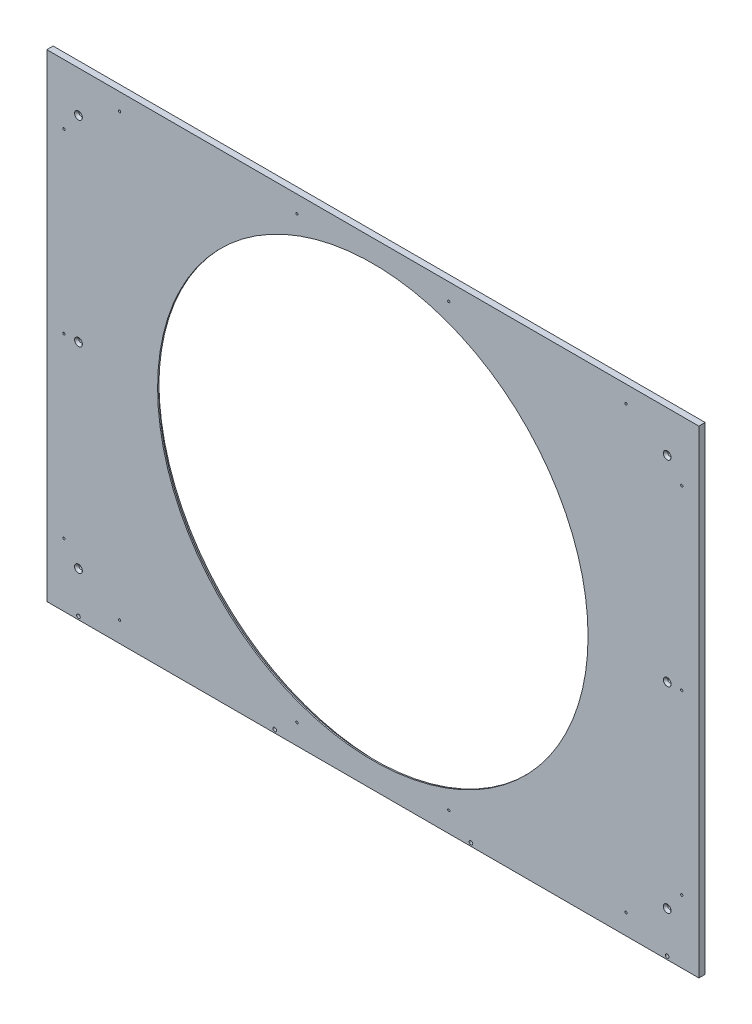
ISO-10303-21;
HEADER;
FILE_DESCRIPTION(('STEP AP214'),'2;1');
FILE_NAME('part.step','',(''),(''),'','','');
FILE_SCHEMA(('AUTOMOTIVE_DESIGN { 1 0 10303 214 1 1 1 1 }'));
ENDSEC;
DATA;
#1=APPLICATION_CONTEXT('core data for automotive mechanical design processes');
#2=APPLICATION_PROTOCOL_DEFINITION('international standard','automotive_design',2000,#1);
#3=PRODUCT_CONTEXT('',#1,'mechanical');
#4=PRODUCT('Part','Part','',(#3));
#5=PRODUCT_RELATED_PRODUCT_CATEGORY('part','',(#4));
#6=PRODUCT_DEFINITION_FORMATION('','',#4);
#7=PRODUCT_DEFINITION_CONTEXT('part definition',#1,'design');
#8=PRODUCT_DEFINITION('design','',#6,#7);
#9=PRODUCT_DEFINITION_SHAPE('','',#8);
#10=(LENGTH_UNIT() NAMED_UNIT(*) SI_UNIT(.MILLI.,.METRE.));
#11=(NAMED_UNIT(*) PLANE_ANGLE_UNIT() SI_UNIT($,.RADIAN.));
#12=(NAMED_UNIT(*) SI_UNIT($,.STERADIAN.) SOLID_ANGLE_UNIT());
#13=UNCERTAINTY_MEASURE_WITH_UNIT(LENGTH_MEASURE(1.E-05),#10,'distance_accuracy_value','');
#14=(GEOMETRIC_REPRESENTATION_CONTEXT(3) GLOBAL_UNCERTAINTY_ASSIGNED_CONTEXT((#13)) GLOBAL_UNIT_ASSIGNED_CONTEXT((#10,
#11,#12)) REPRESENTATION_CONTEXT('',''));
#15=CARTESIAN_POINT('',(0.,0.,0.));
#16=DIRECTION('',(0.,0.,1.));
#17=DIRECTION('',(1.,0.,0.));
#18=AXIS2_PLACEMENT_3D('',#15,#16,#17);
#19=CARTESIAN_POINT('',(0.,0.,6.35));
#20=DIRECTION('',(0.,0.,1.));
#21=DIRECTION('',(1.,0.,0.));
#22=AXIS2_PLACEMENT_3D('',#19,#20,#21);
#23=PLANE('',#22);
#24=CARTESIAN_POINT('',(-295.275,198.4375,6.35));
#25=DIRECTION('',(0.,0.,1.));
#26=DIRECTION('',(1.,0.,0.));
#27=AXIS2_PLACEMENT_3D('',#24,#25,#26);
#28=CIRCLE('',#27,3.89889999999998);
#29=CARTESIAN_POINT('',(-291.3761,198.4375,6.35));
#30=VERTEX_POINT('',#29);
#31=EDGE_CURVE('E319',#30,#30,#28,.T.);
#32=ORIENTED_EDGE('',*,*,#31,.F.);
#33=EDGE_LOOP('',(#32));
#34=FACE_BOUND('',#33,.T.);
#35=CARTESIAN_POINT('',(-295.275,1.58749999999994,6.35));
#36=DIRECTION('',(0.,0.,1.));
#37=DIRECTION('',(1.,0.,0.));
#38=AXIS2_PLACEMENT_3D('',#35,#36,#37);
#39=CIRCLE('',#38,3.89889999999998);
#40=CARTESIAN_POINT('',(-291.3761,1.58749999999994,6.35));
#41=VERTEX_POINT('',#40);
#42=EDGE_CURVE('E310',#41,#41,#39,.T.);
#43=ORIENTED_EDGE('',*,*,#42,.F.);
#44=EDGE_LOOP('',(#43));
#45=FACE_BOUND('',#44,.T.);
#46=CARTESIAN_POINT('',(-295.275,-195.2625,6.35));
#47=DIRECTION('',(0.,0.,1.));
#48=DIRECTION('',(1.,0.,0.));
#49=AXIS2_PLACEMENT_3D('',#46,#47,#48);
#50=CIRCLE('',#49,3.89889999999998);
#51=CARTESIAN_POINT('',(-291.3761,-195.2625,6.35));
#52=VERTEX_POINT('',#51);
#53=EDGE_CURVE('E301',#52,#52,#50,.T.);
#54=ORIENTED_EDGE('',*,*,#53,.F.);
#55=EDGE_LOOP('',(#54));
#56=FACE_BOUND('',#55,.T.);
#57=CARTESIAN_POINT('',(295.275,-195.2625,6.35));
#58=DIRECTION('',(0.,0.,1.));
#59=DIRECTION('',(1.,0.,0.));
#60=AXIS2_PLACEMENT_3D('',#57,#58,#59);
#61=CIRCLE('',#60,3.89889999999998);
#62=CARTESIAN_POINT('',(299.1739,-195.2625,6.35));
#63=VERTEX_POINT('',#62);
#64=EDGE_CURVE('E292',#63,#63,#61,.T.);
#65=ORIENTED_EDGE('',*,*,#64,.F.);
#66=EDGE_LOOP('',(#65));
#67=FACE_BOUND('',#66,.T.);
#68=CARTESIAN_POINT('',(295.275,1.58749999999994,6.35));
#69=DIRECTION('',(0.,0.,1.));
#70=DIRECTION('',(1.,0.,0.));
#71=AXIS2_PLACEMENT_3D('',#68,#69,#70);
#72=CIRCLE('',#71,3.89889999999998);
#73=CARTESIAN_POINT('',(299.1739,1.58749999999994,6.35));
#74=VERTEX_POINT('',#73);
#75=EDGE_CURVE('E283',#74,#74,#72,.T.);
#76=ORIENTED_EDGE('',*,*,#75,.F.);
#77=EDGE_LOOP('',(#76));
#78=FACE_BOUND('',#77,.T.);
#79=CARTESIAN_POINT('',(295.275,198.4375,6.35));
#80=DIRECTION('',(0.,0.,1.));
#81=DIRECTION('',(1.,0.,0.));
#82=AXIS2_PLACEMENT_3D('',#79,#80,#81);
#83=CIRCLE('',#82,3.89889999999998);
#84=CARTESIAN_POINT('',(299.1739,198.4375,6.35));
#85=VERTEX_POINT('',#84);
#86=EDGE_CURVE('E274',#85,#85,#83,.T.);
#87=ORIENTED_EDGE('',*,*,#86,.F.);
#88=EDGE_LOOP('',(#87));
#89=FACE_BOUND('',#88,.T.);
#90=CARTESIAN_POINT('',(-295.275,-236.5375,6.35));
#91=DIRECTION('',(0.,0.,1.));
#92=DIRECTION('',(1.,0.,0.));
#93=AXIS2_PLACEMENT_3D('',#90,#91,#92);
#94=CIRCLE('',#93,1.82880000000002);
#95=CARTESIAN_POINT('',(-293.4462,-236.5375,6.35));
#96=VERTEX_POINT('',#95);
#97=EDGE_CURVE('E265',#96,#96,#94,.T.);
#98=ORIENTED_EDGE('',*,*,#97,.F.);
#99=EDGE_LOOP('',(#98));
#100=FACE_BOUND('',#99,.T.);
#101=CARTESIAN_POINT('',(-98.425,-236.5375,6.35));
#102=DIRECTION('',(0.,0.,1.));
#103=DIRECTION('',(1.,0.,0.));
#104=AXIS2_PLACEMENT_3D('',#101,#102,#103);
#105=CIRCLE('',#104,1.82880000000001);
#106=CARTESIAN_POINT('',(-96.5962,-236.5375,6.35));
#107=VERTEX_POINT('',#106);
#108=EDGE_CURVE('E259',#107,#107,#105,.T.);
#109=ORIENTED_EDGE('',*,*,#108,.F.);
#110=EDGE_LOOP('',(#109));
#111=FACE_BOUND('',#110,.T.);
#112=CARTESIAN_POINT('',(98.425,-236.5375,6.35));
#113=DIRECTION('',(0.,0.,1.));
#114=DIRECTION('',(1.,0.,0.));
#115=AXIS2_PLACEMENT_3D('',#112,#113,#114);
#116=CIRCLE('',#115,1.82880000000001);
#117=CARTESIAN_POINT('',(100.2538,-236.5375,6.35));
#118=VERTEX_POINT('',#117);
#119=EDGE_CURVE('E253',#118,#118,#116,.T.);
#120=ORIENTED_EDGE('',*,*,#119,.F.);
#121=EDGE_LOOP('',(#120));
#122=FACE_BOUND('',#121,.T.);
#123=CARTESIAN_POINT('',(295.275,-236.5375,6.35));
#124=DIRECTION('',(0.,0.,1.));
#125=DIRECTION('',(1.,0.,0.));
#126=AXIS2_PLACEMENT_3D('',#123,#124,#125);
#127=CIRCLE('',#126,1.82880000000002);
#128=CARTESIAN_POINT('',(297.1038,-236.5375,6.35));
#129=VERTEX_POINT('',#128);
#130=EDGE_CURVE('E247',#129,#129,#127,.T.);
#131=ORIENTED_EDGE('',*,*,#130,.F.);
#132=EDGE_LOOP('',(#131));
#133=FACE_BOUND('',#132,.T.);
#134=CARTESIAN_POINT('',(-254.,222.5675,6.35));
#135=DIRECTION('',(0.,0.,1.));
#136=DIRECTION('',(1.,0.,0.));
#137=AXIS2_PLACEMENT_3D('',#134,#135,#136);
#138=CIRCLE('',#137,1.13029999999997);
#139=CARTESIAN_POINT('',(-252.8697,222.5675,6.35));
#140=VERTEX_POINT('',#139);
#141=EDGE_CURVE('E241',#140,#140,#138,.T.);
#142=ORIENTED_EDGE('',*,*,#141,.F.);
#143=EDGE_LOOP('',(#142));
#144=FACE_BOUND('',#143,.T.);
#145=CARTESIAN_POINT('',(-76.2,222.5675,6.35));
#146=DIRECTION('',(0.,0.,1.));
#147=DIRECTION('',(1.,0.,0.));
#148=AXIS2_PLACEMENT_3D('',#145,#146,#147);
#149=CIRCLE('',#148,1.1303);
#150=CARTESIAN_POINT('',(-75.0697,222.5675,6.35));
#151=VERTEX_POINT('',#150);
#152=EDGE_CURVE('E235',#151,#151,#149,.T.);
#153=ORIENTED_EDGE('',*,*,#152,.F.);
#154=EDGE_LOOP('',(#153));
#155=FACE_BOUND('',#154,.T.);
#156=CARTESIAN_POINT('',(76.2,222.5675,6.35));
#157=DIRECTION('',(0.,0.,1.));
#158=DIRECTION('',(1.,0.,0.));
#159=AXIS2_PLACEMENT_3D('',#156,#157,#158);
#160=CIRCLE('',#159,1.1303);
#161=CARTESIAN_POINT('',(77.3303,222.5675,6.35));
#162=VERTEX_POINT('',#161);
#163=EDGE_CURVE('E229',#162,#162,#160,.T.);
#164=ORIENTED_EDGE('',*,*,#163,.F.);
#165=EDGE_LOOP('',(#164));
#166=FACE_BOUND('',#165,.T.);
#167=CARTESIAN_POINT('',(254.,222.5675,6.35));
#168=DIRECTION('',(0.,0.,1.));
#169=DIRECTION('',(1.,0.,0.));
#170=AXIS2_PLACEMENT_3D('',#167,#168,#169);
#171=CIRCLE('',#170,1.13029999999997);
#172=CARTESIAN_POINT('',(255.1303,222.5675,6.35));
#173=VERTEX_POINT('',#172);
#174=EDGE_CURVE('E223',#173,#173,#171,.T.);
#175=ORIENTED_EDGE('',*,*,#174,.F.);
#176=EDGE_LOOP('',(#175));
#177=FACE_BOUND('',#176,.T.);
#178=CARTESIAN_POINT('',(254.,-219.3925,6.35));
#179=DIRECTION('',(0.,0.,1.));
#180=DIRECTION('',(1.,0.,0.));
#181=AXIS2_PLACEMENT_3D('',#178,#179,#180);
#182=CIRCLE('',#181,1.13029999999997);
#183=CARTESIAN_POINT('',(255.1303,-219.3925,6.35));
#184=VERTEX_POINT('',#183);
#185=EDGE_CURVE('E217',#184,#184,#182,.T.);
#186=ORIENTED_EDGE('',*,*,#185,.F.);
#187=EDGE_LOOP('',(#186));
#188=FACE_BOUND('',#187,.T.);
#189=CARTESIAN_POINT('',(76.2000000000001,-219.3925,6.35));
#190=DIRECTION('',(0.,0.,1.));
#191=DIRECTION('',(1.,0.,0.));
#192=AXIS2_PLACEMENT_3D('',#189,#190,#191);
#193=CIRCLE('',#192,1.1303);
#194=CARTESIAN_POINT('',(77.3303000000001,-219.3925,6.35));
#195=VERTEX_POINT('',#194);
#196=EDGE_CURVE('E211',#195,#195,#193,.T.);
#197=ORIENTED_EDGE('',*,*,#196,.F.);
#198=EDGE_LOOP('',(#197));
#199=FACE_BOUND('',#198,.T.);
#200=CARTESIAN_POINT('',(-76.2,-219.3925,6.35));
#201=DIRECTION('',(0.,0.,1.));
#202=DIRECTION('',(1.,0.,0.));
#203=AXIS2_PLACEMENT_3D('',#200,#201,#202);
#204=CIRCLE('',#203,1.1303);
#205=CARTESIAN_POINT('',(-75.0697,-219.3925,6.35));
#206=VERTEX_POINT('',#205);
#207=EDGE_CURVE('E205',#206,#206,#204,.T.);
#208=ORIENTED_EDGE('',*,*,#207,.F.);
#209=EDGE_LOOP('',(#208));
#210=FACE_BOUND('',#209,.T.);
#211=CARTESIAN_POINT('',(-254.,-219.3925,6.35));
#212=DIRECTION('',(0.,0.,1.));
#213=DIRECTION('',(1.,0.,0.));
#214=AXIS2_PLACEMENT_3D('',#211,#212,#213);
#215=CIRCLE('',#214,1.13029999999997);
#216=CARTESIAN_POINT('',(-252.8697,-219.3925,6.35));
#217=VERTEX_POINT('',#216);
#218=EDGE_CURVE('E199',#217,#217,#215,.T.);
#219=ORIENTED_EDGE('',*,*,#218,.F.);
#220=EDGE_LOOP('',(#219));
#221=FACE_BOUND('',#220,.T.);
#222=CARTESIAN_POINT('',(-309.88,179.3875,6.35));
#223=DIRECTION('',(0.,0.,1.));
#224=DIRECTION('',(1.,0.,0.));
#225=AXIS2_PLACEMENT_3D('',#222,#223,#224);
#226=CIRCLE('',#225,1.13029999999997);
#227=CARTESIAN_POINT('',(-308.7497,179.3875,6.35));
#228=VERTEX_POINT('',#227);
#229=EDGE_CURVE('E193',#228,#228,#226,.T.);
#230=ORIENTED_EDGE('',*,*,#229,.F.);
#231=EDGE_LOOP('',(#230));
#232=FACE_BOUND('',#231,.T.);
#233=CARTESIAN_POINT('',(-309.88,-176.2125,6.35));
#234=DIRECTION('',(0.,0.,1.));
#235=DIRECTION('',(1.,0.,0.));
#236=AXIS2_PLACEMENT_3D('',#233,#234,#235);
#237=CIRCLE('',#236,1.13029999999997);
#238=CARTESIAN_POINT('',(-308.7497,-176.2125,6.35));
#239=VERTEX_POINT('',#238);
#240=EDGE_CURVE('E187',#239,#239,#237,.T.);
#241=ORIENTED_EDGE('',*,*,#240,.F.);
#242=EDGE_LOOP('',(#241));
#243=FACE_BOUND('',#242,.T.);
#244=CARTESIAN_POINT('',(309.88,-176.2125,6.35));
#245=DIRECTION('',(0.,0.,1.));
#246=DIRECTION('',(1.,0.,0.));
#247=AXIS2_PLACEMENT_3D('',#244,#245,#246);
#248=CIRCLE('',#247,1.13029999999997);
#249=CARTESIAN_POINT('',(311.0103,-176.2125,6.35));
#250=VERTEX_POINT('',#249);
#251=EDGE_CURVE('E181',#250,#250,#248,.T.);
#252=ORIENTED_EDGE('',*,*,#251,.F.);
#253=EDGE_LOOP('',(#252));
#254=FACE_BOUND('',#253,.T.);
#255=CARTESIAN_POINT('',(309.88,1.58749999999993,6.35));
#256=DIRECTION('',(0.,0.,1.));
#257=DIRECTION('',(1.,0.,0.));
#258=AXIS2_PLACEMENT_3D('',#255,#256,#257);
#259=CIRCLE('',#258,1.13029999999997);
#260=CARTESIAN_POINT('',(311.0103,1.58749999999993,6.35));
#261=VERTEX_POINT('',#260);
#262=EDGE_CURVE('E175',#261,#261,#259,.T.);
#263=ORIENTED_EDGE('',*,*,#262,.F.);
#264=EDGE_LOOP('',(#263));
#265=FACE_BOUND('',#264,.T.);
#266=CARTESIAN_POINT('',(309.88,179.3875,6.35));
#267=DIRECTION('',(0.,0.,1.));
#268=DIRECTION('',(1.,0.,0.));
#269=AXIS2_PLACEMENT_3D('',#266,#267,#268);
#270=CIRCLE('',#269,1.13029999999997);
#271=CARTESIAN_POINT('',(311.0103,179.3875,6.35));
#272=VERTEX_POINT('',#271);
#273=EDGE_CURVE('E169',#272,#272,#270,.T.);
#274=ORIENTED_EDGE('',*,*,#273,.F.);
#275=EDGE_LOOP('',(#274));
#276=FACE_BOUND('',#275,.T.);
#277=CARTESIAN_POINT('',(-309.88,1.58749999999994,6.35));
#278=DIRECTION('',(0.,0.,1.));
#279=DIRECTION('',(1.,0.,0.));
#280=AXIS2_PLACEMENT_3D('',#277,#278,#279);
#281=CIRCLE('',#280,1.13029999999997);
#282=CARTESIAN_POINT('',(-308.7497,1.58749999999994,6.35));
#283=VERTEX_POINT('',#282);
#284=EDGE_CURVE('E163',#283,#283,#281,.T.);
#285=ORIENTED_EDGE('',*,*,#284,.F.);
#286=EDGE_LOOP('',(#285));
#287=FACE_BOUND('',#286,.T.);
#288=DIRECTION('',(0.,-1.,0.));
#289=VECTOR('',#288,1.);
#290=CARTESIAN_POINT('',(-327.025,239.7125,6.35));
#291=LINE('',#290,#289);
#292=CARTESIAN_POINT('',(-327.025,239.7125,6.35));
#293=VERTEX_POINT('',#292);
#294=CARTESIAN_POINT('',(-327.025,-239.7125,6.35));
#295=VERTEX_POINT('',#294);
#296=EDGE_CURVE('E88',#293,#295,#291,.T.);
#297=ORIENTED_EDGE('',*,*,#296,.T.);
#298=DIRECTION('',(1.,0.,0.));
#299=VECTOR('',#298,1.);
#300=CARTESIAN_POINT('',(-327.025,-239.7125,6.35));
#301=LINE('',#300,#299);
#302=CARTESIAN_POINT('',(327.025,-239.7125,6.35));
#303=VERTEX_POINT('',#302);
#304=EDGE_CURVE('E83',#295,#303,#301,.T.);
#305=ORIENTED_EDGE('',*,*,#304,.T.);
#306=DIRECTION('',(0.,1.,0.));
#307=VECTOR('',#306,1.);
#308=CARTESIAN_POINT('',(327.025,239.7125,6.35));
#309=LINE('',#308,#307);
#310=CARTESIAN_POINT('',(327.025,239.7125,6.35));
#311=VERTEX_POINT('',#310);
#312=EDGE_CURVE('E86',#303,#311,#309,.T.);
#313=ORIENTED_EDGE('',*,*,#312,.T.);
#314=DIRECTION('',(-1.,0.,0.));
#315=VECTOR('',#314,1.);
#316=CARTESIAN_POINT('',(-327.025,239.7125,6.35));
#317=LINE('',#316,#315);
#318=EDGE_CURVE('E52',#311,#293,#317,.T.);
#319=ORIENTED_EDGE('',*,*,#318,.T.);
#320=EDGE_LOOP('',(#297,#305,#313,#319));
#321=FACE_BOUND('',#320,.T.);
#322=CARTESIAN_POINT('',(0.,1.58749999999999,6.35));
#323=DIRECTION('',(0.,0.,1.));
#324=DIRECTION('',(1.,0.,0.));
#325=AXIS2_PLACEMENT_3D('',#322,#323,#324);
#326=CIRCLE('',#325,215.9);
#327=CARTESIAN_POINT('',(215.9,1.58749999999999,6.35));
#328=VERTEX_POINT('',#327);
#329=EDGE_CURVE('E106',#328,#328,#326,.T.);
#330=ORIENTED_EDGE('',*,*,#329,.F.);
#331=EDGE_LOOP('',(#330));
#332=FACE_BOUND('',#331,.T.);
#333=ADVANCED_FACE('F35',(#34,#45,#56,#67,#78,#89,#100,#111,#122,#133,#144,#155,#166,#177,#188,
#199,#210,#221,#232,#243,#254,#265,#276,#287,#321,#332),#23,.T.);
#334=CARTESIAN_POINT('',(0.,0.,0.));
#335=DIRECTION('',(0.,0.,1.));
#336=DIRECTION('',(1.,0.,0.));
#337=AXIS2_PLACEMENT_3D('',#334,#335,#336);
#338=PLANE('',#337);
#339=CARTESIAN_POINT('',(-295.275,198.4375,0.));
#340=DIRECTION('',(0.,0.,1.));
#341=DIRECTION('',(1.,0.,0.));
#342=AXIS2_PLACEMENT_3D('',#339,#340,#341);
#343=CIRCLE('',#342,1.82879999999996);
#344=CARTESIAN_POINT('',(-293.4462,198.4375,0.));
#345=VERTEX_POINT('',#344);
#346=EDGE_CURVE('E313',#345,#345,#343,.T.);
#347=ORIENTED_EDGE('',*,*,#346,.T.);
#348=EDGE_LOOP('',(#347));
#349=FACE_BOUND('',#348,.T.);
#350=CARTESIAN_POINT('',(-295.275,1.58749999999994,0.));
#351=DIRECTION('',(0.,0.,1.));
#352=DIRECTION('',(1.,0.,0.));
#353=AXIS2_PLACEMENT_3D('',#350,#351,#352);
#354=CIRCLE('',#353,1.82879999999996);
#355=CARTESIAN_POINT('',(-293.4462,1.58749999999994,0.));
#356=VERTEX_POINT('',#355);
#357=EDGE_CURVE('E304',#356,#356,#354,.T.);
#358=ORIENTED_EDGE('',*,*,#357,.T.);
#359=EDGE_LOOP('',(#358));
#360=FACE_BOUND('',#359,.T.);
#361=CARTESIAN_POINT('',(-295.275,-195.2625,0.));
#362=DIRECTION('',(0.,0.,1.));
#363=DIRECTION('',(1.,0.,0.));
#364=AXIS2_PLACEMENT_3D('',#361,#362,#363);
#365=CIRCLE('',#364,1.82879999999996);
#366=CARTESIAN_POINT('',(-293.4462,-195.2625,0.));
#367=VERTEX_POINT('',#366);
#368=EDGE_CURVE('E295',#367,#367,#365,.T.);
#369=ORIENTED_EDGE('',*,*,#368,.T.);
#370=EDGE_LOOP('',(#369));
#371=FACE_BOUND('',#370,.T.);
#372=CARTESIAN_POINT('',(295.275,-195.2625,0.));
#373=DIRECTION('',(0.,0.,1.));
#374=DIRECTION('',(1.,0.,0.));
#375=AXIS2_PLACEMENT_3D('',#372,#373,#374);
#376=CIRCLE('',#375,1.82879999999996);
#377=CARTESIAN_POINT('',(297.1038,-195.2625,0.));
#378=VERTEX_POINT('',#377);
#379=EDGE_CURVE('E286',#378,#378,#376,.T.);
#380=ORIENTED_EDGE('',*,*,#379,.T.);
#381=EDGE_LOOP('',(#380));
#382=FACE_BOUND('',#381,.T.);
#383=CARTESIAN_POINT('',(295.275,1.58749999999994,0.));
#384=DIRECTION('',(0.,0.,1.));
#385=DIRECTION('',(1.,0.,0.));
#386=AXIS2_PLACEMENT_3D('',#383,#384,#385);
#387=CIRCLE('',#386,1.82879999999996);
#388=CARTESIAN_POINT('',(297.1038,1.58749999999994,0.));
#389=VERTEX_POINT('',#388);
#390=EDGE_CURVE('E277',#389,#389,#387,.T.);
#391=ORIENTED_EDGE('',*,*,#390,.T.);
#392=EDGE_LOOP('',(#391));
#393=FACE_BOUND('',#392,.T.);
#394=CARTESIAN_POINT('',(295.275,198.4375,0.));
#395=DIRECTION('',(0.,0.,1.));
#396=DIRECTION('',(1.,0.,0.));
#397=AXIS2_PLACEMENT_3D('',#394,#395,#396);
#398=CIRCLE('',#397,1.82879999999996);
#399=CARTESIAN_POINT('',(297.1038,198.4375,0.));
#400=VERTEX_POINT('',#399);
#401=EDGE_CURVE('E268',#400,#400,#398,.T.);
#402=ORIENTED_EDGE('',*,*,#401,.T.);
#403=EDGE_LOOP('',(#402));
#404=FACE_BOUND('',#403,.T.);
#405=CARTESIAN_POINT('',(-295.275,-236.5375,0.));
#406=DIRECTION('',(0.,0.,1.));
#407=DIRECTION('',(1.,0.,0.));
#408=AXIS2_PLACEMENT_3D('',#405,#406,#407);
#409=CIRCLE('',#408,1.82880000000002);
#410=CARTESIAN_POINT('',(-293.4462,-236.5375,0.));
#411=VERTEX_POINT('',#410);
#412=EDGE_CURVE('E262',#411,#411,#409,.T.);
#413=ORIENTED_EDGE('',*,*,#412,.T.);
#414=EDGE_LOOP('',(#413));
#415=FACE_BOUND('',#414,.T.);
#416=CARTESIAN_POINT('',(-98.425,-236.5375,0.));
#417=DIRECTION('',(0.,0.,1.));
#418=DIRECTION('',(1.,0.,0.));
#419=AXIS2_PLACEMENT_3D('',#416,#417,#418);
#420=CIRCLE('',#419,1.82879999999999);
#421=CARTESIAN_POINT('',(-96.5962,-236.5375,0.));
#422=VERTEX_POINT('',#421);
#423=EDGE_CURVE('E256',#422,#422,#420,.T.);
#424=ORIENTED_EDGE('',*,*,#423,.T.);
#425=EDGE_LOOP('',(#424));
#426=FACE_BOUND('',#425,.T.);
#427=CARTESIAN_POINT('',(98.425,-236.5375,0.));
#428=DIRECTION('',(0.,0.,1.));
#429=DIRECTION('',(1.,0.,0.));
#430=AXIS2_PLACEMENT_3D('',#427,#428,#429);
#431=CIRCLE('',#430,1.82879999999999);
#432=CARTESIAN_POINT('',(100.2538,-236.5375,0.));
#433=VERTEX_POINT('',#432);
#434=EDGE_CURVE('E250',#433,#433,#431,.T.);
#435=ORIENTED_EDGE('',*,*,#434,.T.);
#436=EDGE_LOOP('',(#435));
#437=FACE_BOUND('',#436,.T.);
#438=CARTESIAN_POINT('',(295.275,-236.5375,0.));
#439=DIRECTION('',(0.,0.,1.));
#440=DIRECTION('',(1.,0.,0.));
#441=AXIS2_PLACEMENT_3D('',#438,#439,#440);
#442=CIRCLE('',#441,1.82880000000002);
#443=CARTESIAN_POINT('',(297.1038,-236.5375,0.));
#444=VERTEX_POINT('',#443);
#445=EDGE_CURVE('E244',#444,#444,#442,.T.);
#446=ORIENTED_EDGE('',*,*,#445,.T.);
#447=EDGE_LOOP('',(#446));
#448=FACE_BOUND('',#447,.T.);
#449=CARTESIAN_POINT('',(-254.,222.5675,0.));
#450=DIRECTION('',(0.,0.,1.));
#451=DIRECTION('',(1.,0.,0.));
#452=AXIS2_PLACEMENT_3D('',#449,#450,#451);
#453=CIRCLE('',#452,1.13029999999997);
#454=CARTESIAN_POINT('',(-252.8697,222.5675,0.));
#455=VERTEX_POINT('',#454);
#456=EDGE_CURVE('E238',#455,#455,#453,.T.);
#457=ORIENTED_EDGE('',*,*,#456,.T.);
#458=EDGE_LOOP('',(#457));
#459=FACE_BOUND('',#458,.T.);
#460=CARTESIAN_POINT('',(-76.2,222.5675,0.));
#461=DIRECTION('',(0.,0.,1.));
#462=DIRECTION('',(1.,0.,0.));
#463=AXIS2_PLACEMENT_3D('',#460,#461,#462);
#464=CIRCLE('',#463,1.1303);
#465=CARTESIAN_POINT('',(-75.0697,222.5675,0.));
#466=VERTEX_POINT('',#465);
#467=EDGE_CURVE('E232',#466,#466,#464,.T.);
#468=ORIENTED_EDGE('',*,*,#467,.T.);
#469=EDGE_LOOP('',(#468));
#470=FACE_BOUND('',#469,.T.);
#471=CARTESIAN_POINT('',(76.2,222.5675,0.));
#472=DIRECTION('',(0.,0.,1.));
#473=DIRECTION('',(1.,0.,0.));
#474=AXIS2_PLACEMENT_3D('',#471,#472,#473);
#475=CIRCLE('',#474,1.1303);
#476=CARTESIAN_POINT('',(77.3303,222.5675,0.));
#477=VERTEX_POINT('',#476);
#478=EDGE_CURVE('E226',#477,#477,#475,.T.);
#479=ORIENTED_EDGE('',*,*,#478,.T.);
#480=EDGE_LOOP('',(#479));
#481=FACE_BOUND('',#480,.T.);
#482=CARTESIAN_POINT('',(254.,222.5675,0.));
#483=DIRECTION('',(0.,0.,1.));
#484=DIRECTION('',(1.,0.,0.));
#485=AXIS2_PLACEMENT_3D('',#482,#483,#484);
#486=CIRCLE('',#485,1.13029999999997);
#487=CARTESIAN_POINT('',(255.1303,222.5675,0.));
#488=VERTEX_POINT('',#487);
#489=EDGE_CURVE('E220',#488,#488,#486,.T.);
#490=ORIENTED_EDGE('',*,*,#489,.T.);
#491=EDGE_LOOP('',(#490));
#492=FACE_BOUND('',#491,.T.);
#493=CARTESIAN_POINT('',(254.,-219.3925,0.));
#494=DIRECTION('',(0.,0.,1.));
#495=DIRECTION('',(1.,0.,0.));
#496=AXIS2_PLACEMENT_3D('',#493,#494,#495);
#497=CIRCLE('',#496,1.13029999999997);
#498=CARTESIAN_POINT('',(255.1303,-219.3925,0.));
#499=VERTEX_POINT('',#498);
#500=EDGE_CURVE('E214',#499,#499,#497,.T.);
#501=ORIENTED_EDGE('',*,*,#500,.T.);
#502=EDGE_LOOP('',(#501));
#503=FACE_BOUND('',#502,.T.);
#504=CARTESIAN_POINT('',(76.2000000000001,-219.3925,0.));
#505=DIRECTION('',(0.,0.,1.));
#506=DIRECTION('',(1.,0.,0.));
#507=AXIS2_PLACEMENT_3D('',#504,#505,#506);
#508=CIRCLE('',#507,1.1303);
#509=CARTESIAN_POINT('',(77.3303000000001,-219.3925,0.));
#510=VERTEX_POINT('',#509);
#511=EDGE_CURVE('E208',#510,#510,#508,.T.);
#512=ORIENTED_EDGE('',*,*,#511,.T.);
#513=EDGE_LOOP('',(#512));
#514=FACE_BOUND('',#513,.T.);
#515=CARTESIAN_POINT('',(-76.2,-219.3925,0.));
#516=DIRECTION('',(0.,0.,1.));
#517=DIRECTION('',(1.,0.,0.));
#518=AXIS2_PLACEMENT_3D('',#515,#516,#517);
#519=CIRCLE('',#518,1.1303);
#520=CARTESIAN_POINT('',(-75.0697,-219.3925,0.));
#521=VERTEX_POINT('',#520);
#522=EDGE_CURVE('E202',#521,#521,#519,.T.);
#523=ORIENTED_EDGE('',*,*,#522,.T.);
#524=EDGE_LOOP('',(#523));
#525=FACE_BOUND('',#524,.T.);
#526=CARTESIAN_POINT('',(-254.,-219.3925,0.));
#527=DIRECTION('',(0.,0.,1.));
#528=DIRECTION('',(1.,0.,0.));
#529=AXIS2_PLACEMENT_3D('',#526,#527,#528);
#530=CIRCLE('',#529,1.13029999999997);
#531=CARTESIAN_POINT('',(-252.8697,-219.3925,0.));
#532=VERTEX_POINT('',#531);
#533=EDGE_CURVE('E196',#532,#532,#530,.T.);
#534=ORIENTED_EDGE('',*,*,#533,.T.);
#535=EDGE_LOOP('',(#534));
#536=FACE_BOUND('',#535,.T.);
#537=CARTESIAN_POINT('',(-309.88,179.3875,0.));
#538=DIRECTION('',(0.,0.,1.));
#539=DIRECTION('',(1.,0.,0.));
#540=AXIS2_PLACEMENT_3D('',#537,#538,#539);
#541=CIRCLE('',#540,1.13029999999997);
#542=CARTESIAN_POINT('',(-308.7497,179.3875,0.));
#543=VERTEX_POINT('',#542);
#544=EDGE_CURVE('E190',#543,#543,#541,.T.);
#545=ORIENTED_EDGE('',*,*,#544,.T.);
#546=EDGE_LOOP('',(#545));
#547=FACE_BOUND('',#546,.T.);
#548=CARTESIAN_POINT('',(-309.88,-176.2125,0.));
#549=DIRECTION('',(0.,0.,1.));
#550=DIRECTION('',(1.,0.,0.));
#551=AXIS2_PLACEMENT_3D('',#548,#549,#550);
#552=CIRCLE('',#551,1.13029999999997);
#553=CARTESIAN_POINT('',(-308.7497,-176.2125,0.));
#554=VERTEX_POINT('',#553);
#555=EDGE_CURVE('E184',#554,#554,#552,.T.);
#556=ORIENTED_EDGE('',*,*,#555,.T.);
#557=EDGE_LOOP('',(#556));
#558=FACE_BOUND('',#557,.T.);
#559=CARTESIAN_POINT('',(309.88,-176.2125,0.));
#560=DIRECTION('',(0.,0.,1.));
#561=DIRECTION('',(1.,0.,0.));
#562=AXIS2_PLACEMENT_3D('',#559,#560,#561);
#563=CIRCLE('',#562,1.13029999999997);
#564=CARTESIAN_POINT('',(311.0103,-176.2125,0.));
#565=VERTEX_POINT('',#564);
#566=EDGE_CURVE('E178',#565,#565,#563,.T.);
#567=ORIENTED_EDGE('',*,*,#566,.T.);
#568=EDGE_LOOP('',(#567));
#569=FACE_BOUND('',#568,.T.);
#570=CARTESIAN_POINT('',(309.88,1.58749999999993,0.));
#571=DIRECTION('',(0.,0.,1.));
#572=DIRECTION('',(1.,0.,0.));
#573=AXIS2_PLACEMENT_3D('',#570,#571,#572);
#574=CIRCLE('',#573,1.13029999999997);
#575=CARTESIAN_POINT('',(311.0103,1.58749999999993,0.));
#576=VERTEX_POINT('',#575);
#577=EDGE_CURVE('E172',#576,#576,#574,.T.);
#578=ORIENTED_EDGE('',*,*,#577,.T.);
#579=EDGE_LOOP('',(#578));
#580=FACE_BOUND('',#579,.T.);
#581=CARTESIAN_POINT('',(309.88,179.3875,0.));
#582=DIRECTION('',(0.,0.,1.));
#583=DIRECTION('',(1.,0.,0.));
#584=AXIS2_PLACEMENT_3D('',#581,#582,#583);
#585=CIRCLE('',#584,1.13029999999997);
#586=CARTESIAN_POINT('',(311.0103,179.3875,0.));
#587=VERTEX_POINT('',#586);
#588=EDGE_CURVE('E166',#587,#587,#585,.T.);
#589=ORIENTED_EDGE('',*,*,#588,.T.);
#590=EDGE_LOOP('',(#589));
#591=FACE_BOUND('',#590,.T.);
#592=CARTESIAN_POINT('',(-309.88,1.58749999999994,0.));
#593=DIRECTION('',(0.,0.,1.));
#594=DIRECTION('',(1.,0.,0.));
#595=AXIS2_PLACEMENT_3D('',#592,#593,#594);
#596=CIRCLE('',#595,1.13029999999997);
#597=CARTESIAN_POINT('',(-308.7497,1.58749999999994,0.));
#598=VERTEX_POINT('',#597);
#599=EDGE_CURVE('E160',#598,#598,#596,.T.);
#600=ORIENTED_EDGE('',*,*,#599,.T.);
#601=EDGE_LOOP('',(#600));
#602=FACE_BOUND('',#601,.T.);
#603=CARTESIAN_POINT('',(0.,1.58749999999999,0.));
#604=DIRECTION('',(0.,0.,1.));
#605=DIRECTION('',(1.,0.,0.));
#606=AXIS2_PLACEMENT_3D('',#603,#604,#605);
#607=CIRCLE('',#606,220.98);
#608=CARTESIAN_POINT('',(220.98,1.58749999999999,0.));
#609=VERTEX_POINT('',#608);
#610=EDGE_CURVE('E44',#609,#609,#607,.T.);
#611=ORIENTED_EDGE('',*,*,#610,.T.);
#612=EDGE_LOOP('',(#611));
#613=FACE_BOUND('',#612,.T.);
#614=DIRECTION('',(0.,-1.,0.));
#615=VECTOR('',#614,1.);
#616=CARTESIAN_POINT('',(-327.025,239.7125,0.));
#617=LINE('',#616,#615);
#618=CARTESIAN_POINT('',(-327.025,239.7125,0.));
#619=VERTEX_POINT('',#618);
#620=CARTESIAN_POINT('',(-327.025,-239.7125,0.));
#621=VERTEX_POINT('',#620);
#622=EDGE_CURVE('E103',#619,#621,#617,.T.);
#623=ORIENTED_EDGE('',*,*,#622,.F.);
#624=DIRECTION('',(-1.,0.,0.));
#625=VECTOR('',#624,1.);
#626=CARTESIAN_POINT('',(-327.025,239.7125,0.));
#627=LINE('',#626,#625);
#628=CARTESIAN_POINT('',(327.025,239.7125,0.));
#629=VERTEX_POINT('',#628);
#630=EDGE_CURVE('E75',#629,#619,#627,.T.);
#631=ORIENTED_EDGE('',*,*,#630,.F.);
#632=DIRECTION('',(0.,1.,0.));
#633=VECTOR('',#632,1.);
#634=CARTESIAN_POINT('',(327.025,239.7125,0.));
#635=LINE('',#634,#633);
#636=CARTESIAN_POINT('',(327.025,-239.7125,0.));
#637=VERTEX_POINT('',#636);
#638=EDGE_CURVE('E69',#637,#629,#635,.T.);
#639=ORIENTED_EDGE('',*,*,#638,.F.);
#640=DIRECTION('',(1.,0.,0.));
#641=VECTOR('',#640,1.);
#642=CARTESIAN_POINT('',(-327.025,-239.7125,0.));
#643=LINE('',#642,#641);
#644=EDGE_CURVE('E93',#621,#637,#643,.T.);
#645=ORIENTED_EDGE('',*,*,#644,.F.);
#646=EDGE_LOOP('',(#623,#631,#639,#645));
#647=FACE_BOUND('',#646,.T.);
#648=ADVANCED_FACE('F115',(#349,#360,#371,#382,#393,#404,#415,#426,#437,#448,#459,#470,#481,
#492,#503,#514,#525,#536,#547,#558,#569,#580,#591,#602,#613,#647),#338,.F.);
#649=CARTESIAN_POINT('',(-327.025,239.7125,6.35));
#650=DIRECTION('',(1.,0.,0.));
#651=DIRECTION('',(0.,1.,0.));
#652=AXIS2_PLACEMENT_3D('',#649,#650,#651);
#653=PLANE('',#652);
#654=ORIENTED_EDGE('',*,*,#622,.T.);
#655=DIRECTION('',(0.,0.,-1.));
#656=VECTOR('',#655,1.);
#657=CARTESIAN_POINT('',(-327.025,-239.7125,6.35));
#658=LINE('',#657,#656);
#659=EDGE_CURVE('E94',#295,#621,#658,.T.);
#660=ORIENTED_EDGE('',*,*,#659,.F.);
#661=ORIENTED_EDGE('',*,*,#296,.F.);
#662=DIRECTION('',(0.,0.,-1.));
#663=VECTOR('',#662,1.);
#664=CARTESIAN_POINT('',(-327.025,239.7125,6.35));
#665=LINE('',#664,#663);
#666=EDGE_CURVE('E99',#293,#619,#665,.T.);
#667=ORIENTED_EDGE('',*,*,#666,.T.);
#668=EDGE_LOOP('',(#654,#660,#661,#667));
#669=FACE_BOUND('',#668,.T.);
#670=ADVANCED_FACE('F140',(#669),#653,.F.);
#671=CARTESIAN_POINT('',(-327.025,-239.7125,6.35));
#672=DIRECTION('',(0.,1.,0.));
#673=DIRECTION('',(0.,0.,1.));
#674=AXIS2_PLACEMENT_3D('',#671,#672,#673);
#675=PLANE('',#674);
#676=ORIENTED_EDGE('',*,*,#644,.T.);
#677=DIRECTION('',(0.,0.,-1.));
#678=VECTOR('',#677,1.);
#679=CARTESIAN_POINT('',(327.025,-239.7125,6.35));
#680=LINE('',#679,#678);
#681=EDGE_CURVE('E91',#303,#637,#680,.T.);
#682=ORIENTED_EDGE('',*,*,#681,.F.);
#683=ORIENTED_EDGE('',*,*,#304,.F.);
#684=ORIENTED_EDGE('',*,*,#659,.T.);
#685=EDGE_LOOP('',(#676,#682,#683,#684));
#686=FACE_BOUND('',#685,.T.);
#687=ADVANCED_FACE('F92',(#686),#675,.F.);
#688=CARTESIAN_POINT('',(327.025,239.7125,6.35));
#689=DIRECTION('',(-1.,0.,0.));
#690=DIRECTION('',(0.,-1.,0.));
#691=AXIS2_PLACEMENT_3D('',#688,#689,#690);
#692=PLANE('',#691);
#693=ORIENTED_EDGE('',*,*,#638,.T.);
#694=DIRECTION('',(0.,0.,-1.));
#695=VECTOR('',#694,1.);
#696=CARTESIAN_POINT('',(327.025,239.7125,6.35));
#697=LINE('',#696,#695);
#698=EDGE_CURVE('E95',#311,#629,#697,.T.);
#699=ORIENTED_EDGE('',*,*,#698,.F.);
#700=ORIENTED_EDGE('',*,*,#312,.F.);
#701=ORIENTED_EDGE('',*,*,#681,.T.);
#702=EDGE_LOOP('',(#693,#699,#700,#701));
#703=FACE_BOUND('',#702,.T.);
#704=ADVANCED_FACE('F97',(#703),#692,.F.);
#705=CARTESIAN_POINT('',(-327.025,239.7125,6.35));
#706=DIRECTION('',(0.,-1.,0.));
#707=DIRECTION('',(0.,0.,-1.));
#708=AXIS2_PLACEMENT_3D('',#705,#706,#707);
#709=PLANE('',#708);
#710=ORIENTED_EDGE('',*,*,#630,.T.);
#711=ORIENTED_EDGE('',*,*,#666,.F.);
#712=ORIENTED_EDGE('',*,*,#318,.F.);
#713=ORIENTED_EDGE('',*,*,#698,.T.);
#714=EDGE_LOOP('',(#710,#711,#712,#713));
#715=FACE_BOUND('',#714,.T.);
#716=ADVANCED_FACE('F129',(#715),#709,.F.);
#717=CARTESIAN_POINT('',(0.,1.58749999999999,6.35));
#718=DIRECTION('',(0.,0.,-1.));
#719=DIRECTION('',(-1.,0.,0.));
#720=AXIS2_PLACEMENT_3D('',#717,#718,#719);
#721=CYLINDRICAL_SURFACE('',#720,215.9);
#722=CARTESIAN_POINT('',(0.,1.58749999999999,5.08));
#723=DIRECTION('',(0.,0.,1.));
#724=DIRECTION('',(1.,0.,0.));
#725=AXIS2_PLACEMENT_3D('',#722,#723,#724);
#726=CIRCLE('',#725,215.9);
#727=CARTESIAN_POINT('',(215.9,1.58749999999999,5.08));
#728=VERTEX_POINT('',#727);
#729=EDGE_CURVE('E11',#728,#728,#726,.F.);
#730=ORIENTED_EDGE('',*,*,#729,.T.);
#731=EDGE_LOOP('',(#730));
#732=FACE_BOUND('',#731,.T.);
#733=ORIENTED_EDGE('',*,*,#329,.T.);
#734=EDGE_LOOP('',(#733));
#735=FACE_BOUND('',#734,.T.);
#736=ADVANCED_FACE('F120',(#732,#735),#721,.F.);
#737=CARTESIAN_POINT('',(0.,1.58749999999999,0.));
#738=DIRECTION('',(0.,0.,-1.));
#739=DIRECTION('',(-1.,0.,0.));
#740=AXIS2_PLACEMENT_3D('',#737,#738,#739);
#741=CONICAL_SURFACE('',#740,220.98,0.78539816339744);
#742=ORIENTED_EDGE('',*,*,#729,.F.);
#743=EDGE_LOOP('',(#742));
#744=FACE_BOUND('',#743,.T.);
#745=ORIENTED_EDGE('',*,*,#610,.F.);
#746=EDGE_LOOP('',(#745));
#747=FACE_BOUND('',#746,.T.);
#748=ADVANCED_FACE('F37',(#744,#747),#741,.F.);
#749=CARTESIAN_POINT('',(-309.88,1.58749999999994,6.35));
#750=DIRECTION('',(0.,0.,1.));
#751=DIRECTION('',(1.,0.,0.));
#752=AXIS2_PLACEMENT_3D('',#749,#750,#751);
#753=CYLINDRICAL_SURFACE('',#752,1.13029999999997);
#754=ORIENTED_EDGE('',*,*,#599,.F.);
#755=EDGE_LOOP('',(#754));
#756=FACE_BOUND('',#755,.T.);
#757=ORIENTED_EDGE('',*,*,#284,.T.);
#758=EDGE_LOOP('',(#757));
#759=FACE_BOUND('',#758,.T.);
#760=ADVANCED_FACE('F119',(#756,#759),#753,.F.);
#761=CARTESIAN_POINT('',(309.88,179.3875,6.35));
#762=DIRECTION('',(0.,0.,1.));
#763=DIRECTION('',(1.,0.,0.));
#764=AXIS2_PLACEMENT_3D('',#761,#762,#763);
#765=CYLINDRICAL_SURFACE('',#764,1.13029999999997);
#766=ORIENTED_EDGE('',*,*,#588,.F.);
#767=EDGE_LOOP('',(#766));
#768=FACE_BOUND('',#767,.T.);
#769=ORIENTED_EDGE('',*,*,#273,.T.);
#770=EDGE_LOOP('',(#769));
#771=FACE_BOUND('',#770,.T.);
#772=ADVANCED_FACE('F126',(#768,#771),#765,.F.);
#773=CARTESIAN_POINT('',(309.88,1.58749999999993,6.35));
#774=DIRECTION('',(0.,0.,1.));
#775=DIRECTION('',(1.,0.,0.));
#776=AXIS2_PLACEMENT_3D('',#773,#774,#775);
#777=CYLINDRICAL_SURFACE('',#776,1.13029999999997);
#778=ORIENTED_EDGE('',*,*,#577,.F.);
#779=EDGE_LOOP('',(#778));
#780=FACE_BOUND('',#779,.T.);
#781=ORIENTED_EDGE('',*,*,#262,.T.);
#782=EDGE_LOOP('',(#781));
#783=FACE_BOUND('',#782,.T.);
#784=ADVANCED_FACE('F433',(#780,#783),#777,.F.);
#785=CARTESIAN_POINT('',(309.88,-176.2125,6.35));
#786=DIRECTION('',(0.,0.,1.));
#787=DIRECTION('',(1.,0.,0.));
#788=AXIS2_PLACEMENT_3D('',#785,#786,#787);
#789=CYLINDRICAL_SURFACE('',#788,1.13029999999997);
#790=ORIENTED_EDGE('',*,*,#566,.F.);
#791=EDGE_LOOP('',(#790));
#792=FACE_BOUND('',#791,.T.);
#793=ORIENTED_EDGE('',*,*,#251,.T.);
#794=EDGE_LOOP('',(#793));
#795=FACE_BOUND('',#794,.T.);
#796=ADVANCED_FACE('F429',(#792,#795),#789,.F.);
#797=CARTESIAN_POINT('',(-309.88,-176.2125,6.35));
#798=DIRECTION('',(0.,0.,1.));
#799=DIRECTION('',(1.,0.,0.));
#800=AXIS2_PLACEMENT_3D('',#797,#798,#799);
#801=CYLINDRICAL_SURFACE('',#800,1.13029999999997);
#802=ORIENTED_EDGE('',*,*,#555,.F.);
#803=EDGE_LOOP('',(#802));
#804=FACE_BOUND('',#803,.T.);
#805=ORIENTED_EDGE('',*,*,#240,.T.);
#806=EDGE_LOOP('',(#805));
#807=FACE_BOUND('',#806,.T.);
#808=ADVANCED_FACE('F425',(#804,#807),#801,.F.);
#809=CARTESIAN_POINT('',(-309.88,179.3875,6.35));
#810=DIRECTION('',(0.,0.,1.));
#811=DIRECTION('',(1.,0.,0.));
#812=AXIS2_PLACEMENT_3D('',#809,#810,#811);
#813=CYLINDRICAL_SURFACE('',#812,1.13029999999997);
#814=ORIENTED_EDGE('',*,*,#544,.F.);
#815=EDGE_LOOP('',(#814));
#816=FACE_BOUND('',#815,.T.);
#817=ORIENTED_EDGE('',*,*,#229,.T.);
#818=EDGE_LOOP('',(#817));
#819=FACE_BOUND('',#818,.T.);
#820=ADVANCED_FACE('F421',(#816,#819),#813,.F.);
#821=CARTESIAN_POINT('',(-254.,-219.3925,6.35));
#822=DIRECTION('',(0.,0.,1.));
#823=DIRECTION('',(1.,0.,0.));
#824=AXIS2_PLACEMENT_3D('',#821,#822,#823);
#825=CYLINDRICAL_SURFACE('',#824,1.13029999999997);
#826=ORIENTED_EDGE('',*,*,#533,.F.);
#827=EDGE_LOOP('',(#826));
#828=FACE_BOUND('',#827,.T.);
#829=ORIENTED_EDGE('',*,*,#218,.T.);
#830=EDGE_LOOP('',(#829));
#831=FACE_BOUND('',#830,.T.);
#832=ADVANCED_FACE('F417',(#828,#831),#825,.F.);
#833=CARTESIAN_POINT('',(-76.2,-219.3925,6.35));
#834=DIRECTION('',(0.,0.,1.));
#835=DIRECTION('',(1.,0.,0.));
#836=AXIS2_PLACEMENT_3D('',#833,#834,#835);
#837=CYLINDRICAL_SURFACE('',#836,1.1303);
#838=ORIENTED_EDGE('',*,*,#522,.F.);
#839=EDGE_LOOP('',(#838));
#840=FACE_BOUND('',#839,.T.);
#841=ORIENTED_EDGE('',*,*,#207,.T.);
#842=EDGE_LOOP('',(#841));
#843=FACE_BOUND('',#842,.T.);
#844=ADVANCED_FACE('F413',(#840,#843),#837,.F.);
#845=CARTESIAN_POINT('',(76.2000000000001,-219.3925,6.35));
#846=DIRECTION('',(0.,0.,1.));
#847=DIRECTION('',(1.,0.,0.));
#848=AXIS2_PLACEMENT_3D('',#845,#846,#847);
#849=CYLINDRICAL_SURFACE('',#848,1.1303);
#850=ORIENTED_EDGE('',*,*,#511,.F.);
#851=EDGE_LOOP('',(#850));
#852=FACE_BOUND('',#851,.T.);
#853=ORIENTED_EDGE('',*,*,#196,.T.);
#854=EDGE_LOOP('',(#853));
#855=FACE_BOUND('',#854,.T.);
#856=ADVANCED_FACE('F409',(#852,#855),#849,.F.);
#857=CARTESIAN_POINT('',(254.,-219.3925,6.35));
#858=DIRECTION('',(0.,0.,1.));
#859=DIRECTION('',(1.,0.,0.));
#860=AXIS2_PLACEMENT_3D('',#857,#858,#859);
#861=CYLINDRICAL_SURFACE('',#860,1.13029999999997);
#862=ORIENTED_EDGE('',*,*,#500,.F.);
#863=EDGE_LOOP('',(#862));
#864=FACE_BOUND('',#863,.T.);
#865=ORIENTED_EDGE('',*,*,#185,.T.);
#866=EDGE_LOOP('',(#865));
#867=FACE_BOUND('',#866,.T.);
#868=ADVANCED_FACE('F405',(#864,#867),#861,.F.);
#869=CARTESIAN_POINT('',(254.,222.5675,6.35));
#870=DIRECTION('',(0.,0.,1.));
#871=DIRECTION('',(1.,0.,0.));
#872=AXIS2_PLACEMENT_3D('',#869,#870,#871);
#873=CYLINDRICAL_SURFACE('',#872,1.13029999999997);
#874=ORIENTED_EDGE('',*,*,#489,.F.);
#875=EDGE_LOOP('',(#874));
#876=FACE_BOUND('',#875,.T.);
#877=ORIENTED_EDGE('',*,*,#174,.T.);
#878=EDGE_LOOP('',(#877));
#879=FACE_BOUND('',#878,.T.);
#880=ADVANCED_FACE('F401',(#876,#879),#873,.F.);
#881=CARTESIAN_POINT('',(76.2,222.5675,6.35));
#882=DIRECTION('',(0.,0.,1.));
#883=DIRECTION('',(1.,0.,0.));
#884=AXIS2_PLACEMENT_3D('',#881,#882,#883);
#885=CYLINDRICAL_SURFACE('',#884,1.1303);
#886=ORIENTED_EDGE('',*,*,#478,.F.);
#887=EDGE_LOOP('',(#886));
#888=FACE_BOUND('',#887,.T.);
#889=ORIENTED_EDGE('',*,*,#163,.T.);
#890=EDGE_LOOP('',(#889));
#891=FACE_BOUND('',#890,.T.);
#892=ADVANCED_FACE('F397',(#888,#891),#885,.F.);
#893=CARTESIAN_POINT('',(-76.2,222.5675,6.35));
#894=DIRECTION('',(0.,0.,1.));
#895=DIRECTION('',(1.,0.,0.));
#896=AXIS2_PLACEMENT_3D('',#893,#894,#895);
#897=CYLINDRICAL_SURFACE('',#896,1.1303);
#898=ORIENTED_EDGE('',*,*,#467,.F.);
#899=EDGE_LOOP('',(#898));
#900=FACE_BOUND('',#899,.T.);
#901=ORIENTED_EDGE('',*,*,#152,.T.);
#902=EDGE_LOOP('',(#901));
#903=FACE_BOUND('',#902,.T.);
#904=ADVANCED_FACE('F393',(#900,#903),#897,.F.);
#905=CARTESIAN_POINT('',(-254.,222.5675,6.35));
#906=DIRECTION('',(0.,0.,1.));
#907=DIRECTION('',(1.,0.,0.));
#908=AXIS2_PLACEMENT_3D('',#905,#906,#907);
#909=CYLINDRICAL_SURFACE('',#908,1.13029999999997);
#910=ORIENTED_EDGE('',*,*,#456,.F.);
#911=EDGE_LOOP('',(#910));
#912=FACE_BOUND('',#911,.T.);
#913=ORIENTED_EDGE('',*,*,#141,.T.);
#914=EDGE_LOOP('',(#913));
#915=FACE_BOUND('',#914,.T.);
#916=ADVANCED_FACE('F389',(#912,#915),#909,.F.);
#917=CARTESIAN_POINT('',(295.275,-236.5375,6.35));
#918=DIRECTION('',(0.,0.,1.));
#919=DIRECTION('',(1.,0.,0.));
#920=AXIS2_PLACEMENT_3D('',#917,#918,#919);
#921=CYLINDRICAL_SURFACE('',#920,1.82880000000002);
#922=ORIENTED_EDGE('',*,*,#445,.F.);
#923=EDGE_LOOP('',(#922));
#924=FACE_BOUND('',#923,.T.);
#925=ORIENTED_EDGE('',*,*,#130,.T.);
#926=EDGE_LOOP('',(#925));
#927=FACE_BOUND('',#926,.T.);
#928=ADVANCED_FACE('F385',(#924,#927),#921,.F.);
#929=CARTESIAN_POINT('',(98.425,-236.5375,6.35));
#930=DIRECTION('',(0.,0.,1.));
#931=DIRECTION('',(1.,0.,0.));
#932=AXIS2_PLACEMENT_3D('',#929,#930,#931);
#933=CYLINDRICAL_SURFACE('',#932,1.8288);
#934=ORIENTED_EDGE('',*,*,#434,.F.);
#935=EDGE_LOOP('',(#934));
#936=FACE_BOUND('',#935,.T.);
#937=ORIENTED_EDGE('',*,*,#119,.T.);
#938=EDGE_LOOP('',(#937));
#939=FACE_BOUND('',#938,.T.);
#940=ADVANCED_FACE('F381',(#936,#939),#933,.F.);
#941=CARTESIAN_POINT('',(-98.425,-236.5375,6.35));
#942=DIRECTION('',(0.,0.,1.));
#943=DIRECTION('',(1.,0.,0.));
#944=AXIS2_PLACEMENT_3D('',#941,#942,#943);
#945=CYLINDRICAL_SURFACE('',#944,1.8288);
#946=ORIENTED_EDGE('',*,*,#423,.F.);
#947=EDGE_LOOP('',(#946));
#948=FACE_BOUND('',#947,.T.);
#949=ORIENTED_EDGE('',*,*,#108,.T.);
#950=EDGE_LOOP('',(#949));
#951=FACE_BOUND('',#950,.T.);
#952=ADVANCED_FACE('F377',(#948,#951),#945,.F.);
#953=CARTESIAN_POINT('',(-295.275,-236.5375,6.35));
#954=DIRECTION('',(0.,0.,1.));
#955=DIRECTION('',(1.,0.,0.));
#956=AXIS2_PLACEMENT_3D('',#953,#954,#955);
#957=CYLINDRICAL_SURFACE('',#956,1.82880000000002);
#958=ORIENTED_EDGE('',*,*,#412,.F.);
#959=EDGE_LOOP('',(#958));
#960=FACE_BOUND('',#959,.T.);
#961=ORIENTED_EDGE('',*,*,#97,.T.);
#962=EDGE_LOOP('',(#961));
#963=FACE_BOUND('',#962,.T.);
#964=ADVANCED_FACE('F373',(#960,#963),#957,.F.);
#965=CARTESIAN_POINT('',(295.275,198.4375,6.35));
#966=DIRECTION('',(0.,0.,1.));
#967=DIRECTION('',(1.,0.,0.));
#968=AXIS2_PLACEMENT_3D('',#965,#966,#967);
#969=CYLINDRICAL_SURFACE('',#968,1.82879999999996);
#970=ORIENTED_EDGE('',*,*,#401,.F.);
#971=EDGE_LOOP('',(#970));
#972=FACE_BOUND('',#971,.T.);
#973=CARTESIAN_POINT('',(295.275,198.4375,3.96862236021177));
#974=DIRECTION('',(0.,0.,1.));
#975=DIRECTION('',(1.,0.,0.));
#976=AXIS2_PLACEMENT_3D('',#973,#974,#975);
#977=CIRCLE('',#976,1.82879999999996);
#978=CARTESIAN_POINT('',(297.1038,198.4375,3.96862236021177));
#979=VERTEX_POINT('',#978);
#980=EDGE_CURVE('E271',#979,#979,#977,.T.);
#981=ORIENTED_EDGE('',*,*,#980,.T.);
#982=EDGE_LOOP('',(#981));
#983=FACE_BOUND('',#982,.T.);
#984=ADVANCED_FACE('F369',(#972,#983),#969,.F.);
#985=CARTESIAN_POINT('',(295.275,198.4375,6.35));
#986=DIRECTION('',(0.,0.,1.));
#987=DIRECTION('',(1.,0.,0.));
#988=AXIS2_PLACEMENT_3D('',#985,#986,#987);
#989=CONICAL_SURFACE('',#988,3.89889999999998,0.715584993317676);
#990=ORIENTED_EDGE('',*,*,#980,.F.);
#991=EDGE_LOOP('',(#990));
#992=FACE_BOUND('',#991,.T.);
#993=ORIENTED_EDGE('',*,*,#86,.T.);
#994=EDGE_LOOP('',(#993));
#995=FACE_BOUND('',#994,.T.);
#996=ADVANCED_FACE('F365',(#992,#995),#989,.F.);
#997=CARTESIAN_POINT('',(295.275,1.58749999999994,6.35));
#998=DIRECTION('',(0.,0.,1.));
#999=DIRECTION('',(1.,0.,0.));
#1000=AXIS2_PLACEMENT_3D('',#997,#998,#999);
#1001=CYLINDRICAL_SURFACE('',#1000,1.82879999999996);
#1002=ORIENTED_EDGE('',*,*,#390,.F.);
#1003=EDGE_LOOP('',(#1002));
#1004=FACE_BOUND('',#1003,.T.);
#1005=CARTESIAN_POINT('',(295.275,1.58749999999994,3.96862236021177));
#1006=DIRECTION('',(0.,0.,1.));
#1007=DIRECTION('',(1.,0.,0.));
#1008=AXIS2_PLACEMENT_3D('',#1005,#1006,#1007);
#1009=CIRCLE('',#1008,1.82879999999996);
#1010=CARTESIAN_POINT('',(297.1038,1.58749999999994,3.96862236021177));
#1011=VERTEX_POINT('',#1010);
#1012=EDGE_CURVE('E280',#1011,#1011,#1009,.T.);
#1013=ORIENTED_EDGE('',*,*,#1012,.T.);
#1014=EDGE_LOOP('',(#1013));
#1015=FACE_BOUND('',#1014,.T.);
#1016=ADVANCED_FACE('F361',(#1004,#1015),#1001,.F.);
#1017=CARTESIAN_POINT('',(295.275,1.58749999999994,6.35));
#1018=DIRECTION('',(0.,0.,1.));
#1019=DIRECTION('',(1.,0.,0.));
#1020=AXIS2_PLACEMENT_3D('',#1017,#1018,#1019);
#1021=CONICAL_SURFACE('',#1020,3.89889999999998,0.715584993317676);
#1022=ORIENTED_EDGE('',*,*,#1012,.F.);
#1023=EDGE_LOOP('',(#1022));
#1024=FACE_BOUND('',#1023,.T.);
#1025=ORIENTED_EDGE('',*,*,#75,.T.);
#1026=EDGE_LOOP('',(#1025));
#1027=FACE_BOUND('',#1026,.T.);
#1028=ADVANCED_FACE('F357',(#1024,#1027),#1021,.F.);
#1029=CARTESIAN_POINT('',(295.275,-195.2625,6.35));
#1030=DIRECTION('',(0.,0.,1.));
#1031=DIRECTION('',(1.,0.,0.));
#1032=AXIS2_PLACEMENT_3D('',#1029,#1030,#1031);
#1033=CYLINDRICAL_SURFACE('',#1032,1.82879999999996);
#1034=ORIENTED_EDGE('',*,*,#379,.F.);
#1035=EDGE_LOOP('',(#1034));
#1036=FACE_BOUND('',#1035,.T.);
#1037=CARTESIAN_POINT('',(295.275,-195.2625,3.96862236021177));
#1038=DIRECTION('',(0.,0.,1.));
#1039=DIRECTION('',(1.,0.,0.));
#1040=AXIS2_PLACEMENT_3D('',#1037,#1038,#1039);
#1041=CIRCLE('',#1040,1.82879999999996);
#1042=CARTESIAN_POINT('',(297.1038,-195.2625,3.96862236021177));
#1043=VERTEX_POINT('',#1042);
#1044=EDGE_CURVE('E289',#1043,#1043,#1041,.T.);
#1045=ORIENTED_EDGE('',*,*,#1044,.T.);
#1046=EDGE_LOOP('',(#1045));
#1047=FACE_BOUND('',#1046,.T.);
#1048=ADVANCED_FACE('F353',(#1036,#1047),#1033,.F.);
#1049=CARTESIAN_POINT('',(295.275,-195.2625,6.35));
#1050=DIRECTION('',(0.,0.,1.));
#1051=DIRECTION('',(1.,0.,0.));
#1052=AXIS2_PLACEMENT_3D('',#1049,#1050,#1051);
#1053=CONICAL_SURFACE('',#1052,3.89889999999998,0.715584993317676);
#1054=ORIENTED_EDGE('',*,*,#1044,.F.);
#1055=EDGE_LOOP('',(#1054));
#1056=FACE_BOUND('',#1055,.T.);
#1057=ORIENTED_EDGE('',*,*,#64,.T.);
#1058=EDGE_LOOP('',(#1057));
#1059=FACE_BOUND('',#1058,.T.);
#1060=ADVANCED_FACE('F349',(#1056,#1059),#1053,.F.);
#1061=CARTESIAN_POINT('',(-295.275,-195.2625,6.35));
#1062=DIRECTION('',(0.,0.,1.));
#1063=DIRECTION('',(1.,0.,0.));
#1064=AXIS2_PLACEMENT_3D('',#1061,#1062,#1063);
#1065=CYLINDRICAL_SURFACE('',#1064,1.82879999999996);
#1066=ORIENTED_EDGE('',*,*,#368,.F.);
#1067=EDGE_LOOP('',(#1066));
#1068=FACE_BOUND('',#1067,.T.);
#1069=CARTESIAN_POINT('',(-295.275,-195.2625,3.96862236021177));
#1070=DIRECTION('',(0.,0.,1.));
#1071=DIRECTION('',(1.,0.,0.));
#1072=AXIS2_PLACEMENT_3D('',#1069,#1070,#1071);
#1073=CIRCLE('',#1072,1.82879999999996);
#1074=CARTESIAN_POINT('',(-293.4462,-195.2625,3.96862236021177));
#1075=VERTEX_POINT('',#1074);
#1076=EDGE_CURVE('E298',#1075,#1075,#1073,.T.);
#1077=ORIENTED_EDGE('',*,*,#1076,.T.);
#1078=EDGE_LOOP('',(#1077));
#1079=FACE_BOUND('',#1078,.T.);
#1080=ADVANCED_FACE('F345',(#1068,#1079),#1065,.F.);
#1081=CARTESIAN_POINT('',(-295.275,-195.2625,6.35));
#1082=DIRECTION('',(0.,0.,1.));
#1083=DIRECTION('',(1.,0.,0.));
#1084=AXIS2_PLACEMENT_3D('',#1081,#1082,#1083);
#1085=CONICAL_SURFACE('',#1084,3.89889999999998,0.715584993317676);
#1086=ORIENTED_EDGE('',*,*,#1076,.F.);
#1087=EDGE_LOOP('',(#1086));
#1088=FACE_BOUND('',#1087,.T.);
#1089=ORIENTED_EDGE('',*,*,#53,.T.);
#1090=EDGE_LOOP('',(#1089));
#1091=FACE_BOUND('',#1090,.T.);
#1092=ADVANCED_FACE('F341',(#1088,#1091),#1085,.F.);
#1093=CARTESIAN_POINT('',(-295.275,1.58749999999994,6.35));
#1094=DIRECTION('',(0.,0.,1.));
#1095=DIRECTION('',(1.,0.,0.));
#1096=AXIS2_PLACEMENT_3D('',#1093,#1094,#1095);
#1097=CYLINDRICAL_SURFACE('',#1096,1.82879999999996);
#1098=ORIENTED_EDGE('',*,*,#357,.F.);
#1099=EDGE_LOOP('',(#1098));
#1100=FACE_BOUND('',#1099,.T.);
#1101=CARTESIAN_POINT('',(-295.275,1.58749999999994,3.96862236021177));
#1102=DIRECTION('',(0.,0.,1.));
#1103=DIRECTION('',(1.,0.,0.));
#1104=AXIS2_PLACEMENT_3D('',#1101,#1102,#1103);
#1105=CIRCLE('',#1104,1.82879999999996);
#1106=CARTESIAN_POINT('',(-293.4462,1.58749999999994,3.96862236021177));
#1107=VERTEX_POINT('',#1106);
#1108=EDGE_CURVE('E307',#1107,#1107,#1105,.T.);
#1109=ORIENTED_EDGE('',*,*,#1108,.T.);
#1110=EDGE_LOOP('',(#1109));
#1111=FACE_BOUND('',#1110,.T.);
#1112=ADVANCED_FACE('F337',(#1100,#1111),#1097,.F.);
#1113=CARTESIAN_POINT('',(-295.275,1.58749999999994,6.35));
#1114=DIRECTION('',(0.,0.,1.));
#1115=DIRECTION('',(1.,0.,0.));
#1116=AXIS2_PLACEMENT_3D('',#1113,#1114,#1115);
#1117=CONICAL_SURFACE('',#1116,3.89889999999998,0.715584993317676);
#1118=ORIENTED_EDGE('',*,*,#1108,.F.);
#1119=EDGE_LOOP('',(#1118));
#1120=FACE_BOUND('',#1119,.T.);
#1121=ORIENTED_EDGE('',*,*,#42,.T.);
#1122=EDGE_LOOP('',(#1121));
#1123=FACE_BOUND('',#1122,.T.);
#1124=ADVANCED_FACE('F330',(#1120,#1123),#1117,.F.);
#1125=CARTESIAN_POINT('',(-295.275,198.4375,6.35));
#1126=DIRECTION('',(0.,0.,1.));
#1127=DIRECTION('',(1.,0.,0.));
#1128=AXIS2_PLACEMENT_3D('',#1125,#1126,#1127);
#1129=CYLINDRICAL_SURFACE('',#1128,1.82879999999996);
#1130=ORIENTED_EDGE('',*,*,#346,.F.);
#1131=EDGE_LOOP('',(#1130));
#1132=FACE_BOUND('',#1131,.T.);
#1133=CARTESIAN_POINT('',(-295.275,198.4375,3.96862236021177));
#1134=DIRECTION('',(0.,0.,1.));
#1135=DIRECTION('',(1.,0.,0.));
#1136=AXIS2_PLACEMENT_3D('',#1133,#1134,#1135);
#1137=CIRCLE('',#1136,1.82879999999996);
#1138=CARTESIAN_POINT('',(-293.4462,198.4375,3.96862236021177));
#1139=VERTEX_POINT('',#1138);
#1140=EDGE_CURVE('E316',#1139,#1139,#1137,.T.);
#1141=ORIENTED_EDGE('',*,*,#1140,.T.);
#1142=EDGE_LOOP('',(#1141));
#1143=FACE_BOUND('',#1142,.T.);
#1144=ADVANCED_FACE('F324',(#1132,#1143),#1129,.F.);
#1145=CARTESIAN_POINT('',(-295.275,198.4375,6.35));
#1146=DIRECTION('',(0.,0.,1.));
#1147=DIRECTION('',(1.,0.,0.));
#1148=AXIS2_PLACEMENT_3D('',#1145,#1146,#1147);
#1149=CONICAL_SURFACE('',#1148,3.89889999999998,0.715584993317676);
#1150=ORIENTED_EDGE('',*,*,#1140,.F.);
#1151=EDGE_LOOP('',(#1150));
#1152=FACE_BOUND('',#1151,.T.);
#1153=ORIENTED_EDGE('',*,*,#31,.T.);
#1154=EDGE_LOOP('',(#1153));
#1155=FACE_BOUND('',#1154,.T.);
#1156=ADVANCED_FACE('F322',(#1152,#1155),#1149,.F.);
#1157=CLOSED_SHELL('',(#333,#648,#670,#687,#704,#716,#736,#748,#760,#772,#784,#796,#808,#820,
#832,#844,#856,#868,#880,#892,#904,#916,#928,#940,#952,#964,#984,#996,#1016,#1028,#1048,#1060,
#1080,#1092,#1112,#1124,#1144,#1156));
#1158=MANIFOLD_SOLID_BREP('B2',#1157);
#1159=ADVANCED_BREP_SHAPE_REPRESENTATION('',(#18,#1158),#14);
#1160=SHAPE_DEFINITION_REPRESENTATION(#9,#1159);
ENDSEC;
END-ISO-10303-21;
